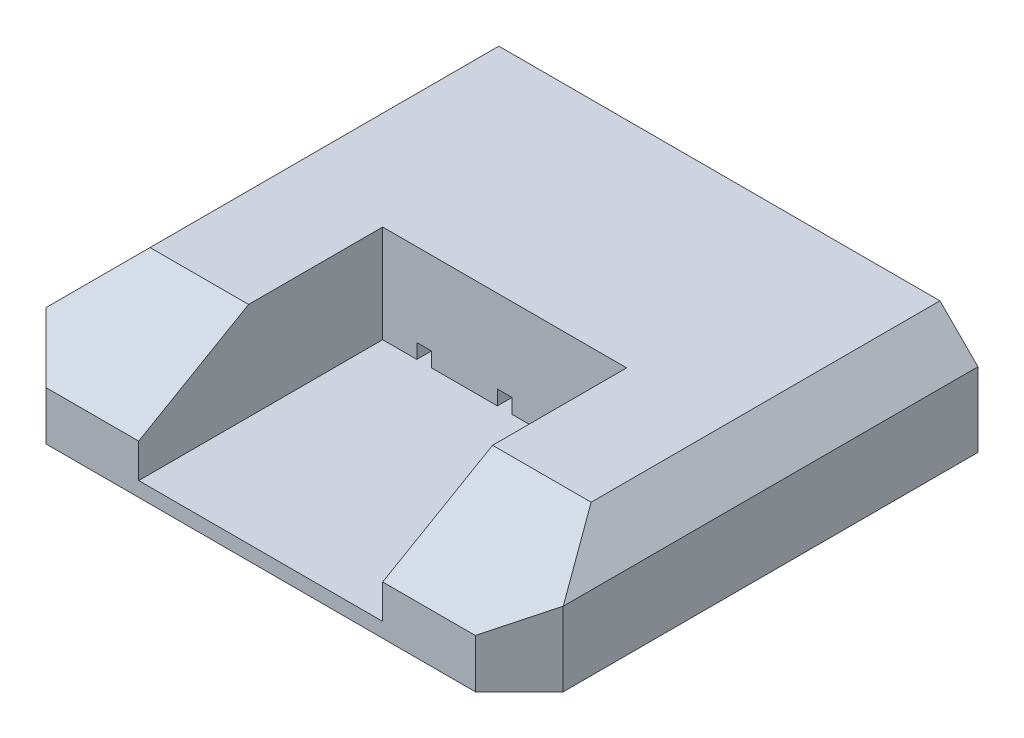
from build123d import *

# Parameters (mm, degrees)
SKETCH_1_W          = 1060
SKETCH_1_H          = 940
EXTRUDE_1_DEPTH     = 230
SKETCH_2_W          = 500
SKETCH_2_H          = 500
CUT_EXTRUDE_1_DEPTH = 200
CHAMFER_1_SIZE      = 90
CHAMFER_2_SIZE      = 130
CHAMFER_2_SIZE2     = 225.166604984
CHAMFER_3_SIZE      = 78
SKETCH_3_W          = 30
SKETCH_3_H          = 30
CUT_EXTRUDE_2_DEPTH = 50


with BuildPart() as part:
    # Sketch 1 → Extrude 1 (new body)
    with BuildSketch(Plane(origin=(0, 0, 0), x_dir=(1, 0, 0), z_dir=(0, 1, 0))):
        Rectangle(SKETCH_1_W, SKETCH_1_H)
    extrude(amount=EXTRUDE_1_DEPTH)

    # Sketch 2 → Cut-Extrude 1 (cut)
    with BuildSketch(Plane(origin=(0, 230, 0), x_dir=(1, 0, 0), z_dir=(0, 1, 0))):
        with Locations((0, -220)):
            Rectangle(SKETCH_2_W, SKETCH_2_H)
    extrude(amount=-CUT_EXTRUDE_1_DEPTH, mode=Mode.SUBTRACT)

    # Chamfer 1
    chamfer_1_edges = [part.edges().sort_by_distance(p)[0] for p in [
        (530, 115, 470),
        (-530, 115, 470),
    ]]
    chamfer(chamfer_1_edges, length=CHAMFER_1_SIZE)

    # Chamfer 2
    chamfer_2_edges = [part.edges().sort_by_distance(p)[0] for p in [
        (-345, 230, 470),
        (345, 230, 470),
    ]]
    chamfer_2_side = [part.faces().sort_by_distance(p)[0] for p in [
        (0, 9.095603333, 470),
    ]]
    chamfer(chamfer_2_edges, length=CHAMFER_2_SIZE, length2=CHAMFER_2_SIZE2, reference=chamfer_2_side[0])

    # Chamfer 3
    chamfer_3_edges = [part.edges().sort_by_distance(p)[0] for p in [
        (-530, 230, -112.583302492),
        (530, 230, -112.583302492),
    ]]
    chamfer(chamfer_3_edges, length=CHAMFER_3_SIZE)

    # Sketch 3 → Cut-Extrude 2 (cut)
    with BuildSketch(Plane.XY.offset(-30)):
        with Locations((0, 45)):
            Rectangle(SKETCH_3_W, SKETCH_3_H)
        with Locations((-165, 45)):
            Rectangle(SKETCH_3_W, SKETCH_3_H)
        with Locations((165, 45)):
            Rectangle(SKETCH_3_W, SKETCH_3_H)
    extrude(amount=-CUT_EXTRUDE_2_DEPTH, mode=Mode.SUBTRACT)


solid = part.part
